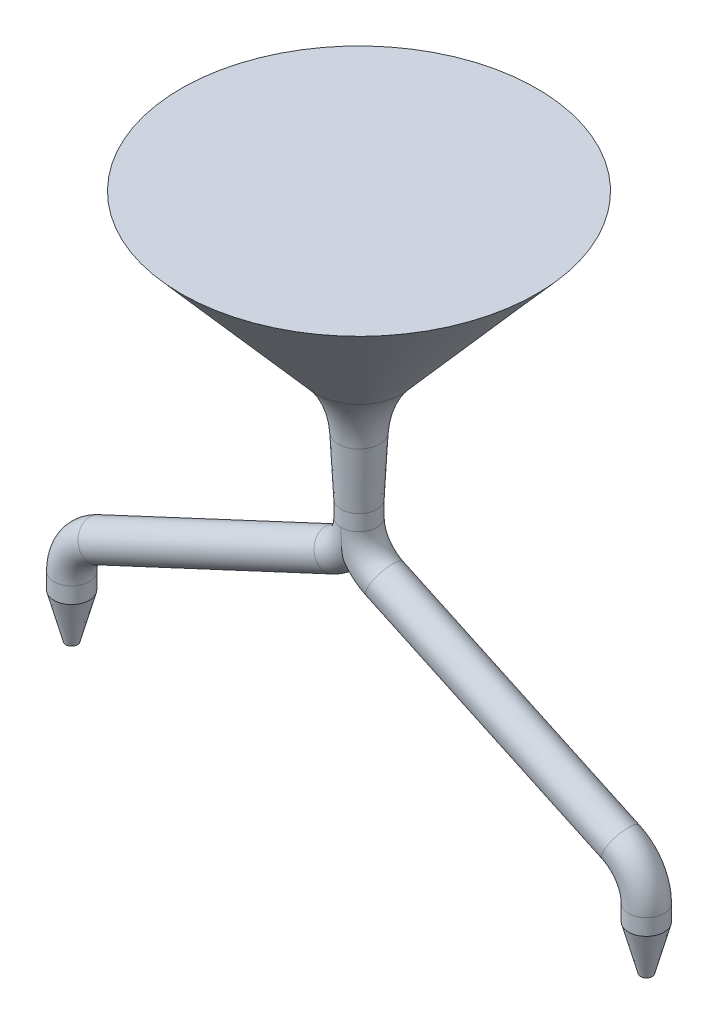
from build123d import *

# Parameters (mm, degrees)
SKETCH7_R           = 2
FILLET1_R           = 10
SKETCH9_R           = 2
BOSS_EXTRUDE1_DEPTH = 5
BOSS_EXTRUDE1_TAPER = 15


with BuildPart() as part:
    # Sketch2 → Revolve1 (revolve)
    with BuildSketch(Plane.XY, mode=Mode.PRIVATE) as revolve1_sk:
        Polygon((0, 0), (0, 30), (20, 30), (2.5, 10), (2, 0), align=None)
    revolve(revolve1_sk.sketch.rotate(Axis((0, 0, 0), (0, 1, 0)), 270), axis=Axis((0, 0, 0), (0, 1, 0)))

    # Sweep2: sweep along a path in Sketch5
    with BuildLine(Plane.XY) as sweep2_path:
        Line((32.31, -25), (32.31, -23.185351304))
        ThreePointArc((32.31, -23.185351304), (31.526957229, -20.498853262), (29.423091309, -18.653812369))
        Line((29.423091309, -18.653812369), (2.886908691, -6.279787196))
        ThreePointArc((2.886908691, -6.279787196), (0.783042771, -4.434746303), (0, -1.748248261))
        Line((0, -1.748248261), (0, 0))
    # Sketch7 → Sweep2 (sweep)
    with BuildSketch(Plane.XZ):
        Circle(SKETCH7_R)
    sweep2 = sweep(path=sweep2_path.line)

    # Fillet1
    fillet1_edges = [part.edges().sort_by_distance(p)[0] for p in [
        (0, 10, -2.5),
    ]]
    fillet(fillet1_edges, radius=FILLET1_R)

    # Sketch9 → Boss-Extrude1 (add)
    with BuildSketch(Plane.XZ.offset(25)):
        with Locations((32.31, 0)):
            Circle(SKETCH9_R)
    boss_extrude1 = extrude(amount=BOSS_EXTRUDE1_DEPTH, taper=BOSS_EXTRUDE1_TAPER)

    # Mirror1: Sweep2, Boss-Extrude1 across plane
    add(sweep2.mirror(Plane(origin=(0, 0, 0), x_dir=(0, 0, 1), z_dir=(1, 0, 0))))
    add(boss_extrude1.mirror(Plane(origin=(0, 0, 0), x_dir=(0, 0, 1), z_dir=(1, 0, 0))))


solid = part.part
